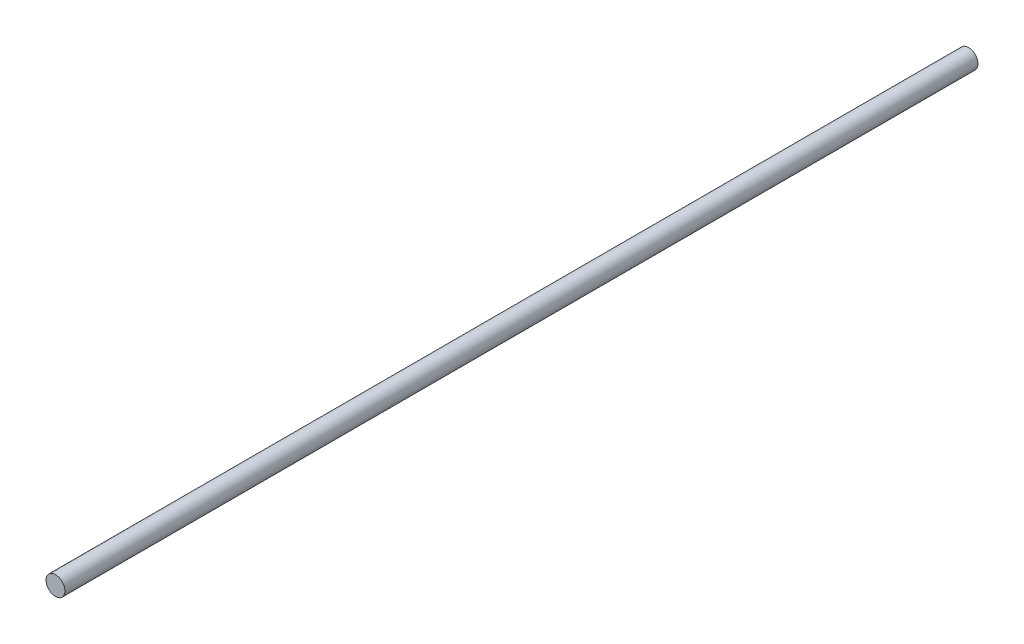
from build123d import *

# Parameters (mm, degrees)
SKETCH_1_R      = 4
EXTRUDE_1_DEPTH = 385


with BuildPart() as part:
    # Sketch 1 → Extrude 1 (new body)
    with BuildSketch(Plane.XY):
        Circle(SKETCH_1_R)
    extrude(amount=EXTRUDE_1_DEPTH)


solid = part.part
